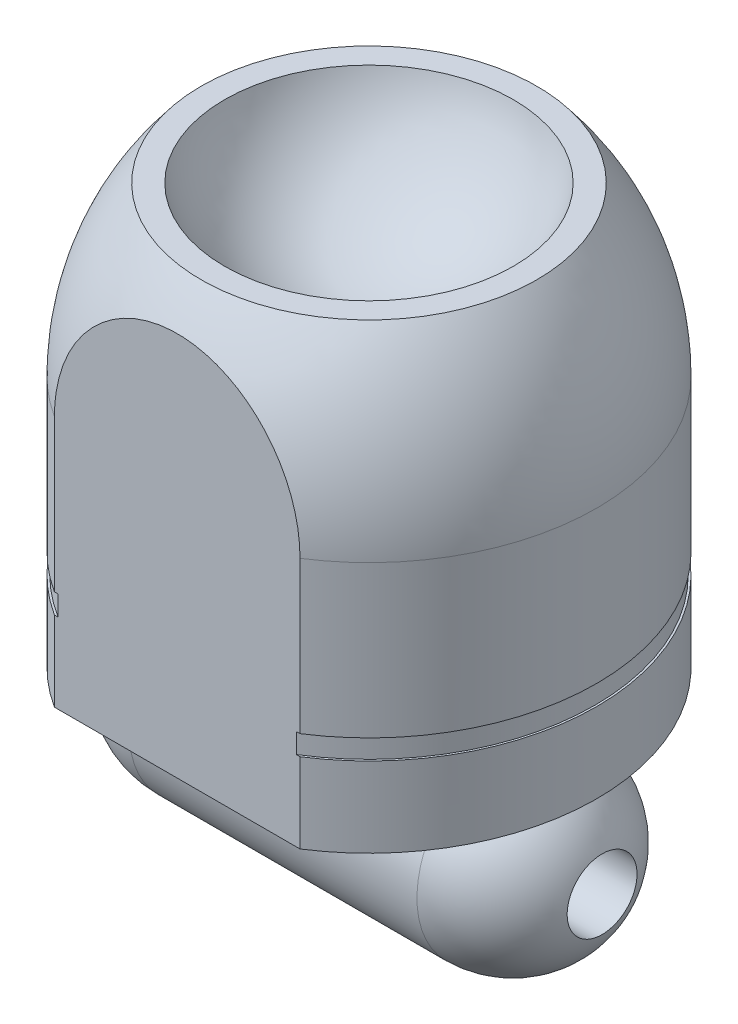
from build123d import *

# Parameters (mm, degrees)
ENL_V_MAT_EXTRU_1_DEPTH      = 265.74893784
ENL_V_MAT_EXTRU_1_DEPTH_BACK = 265.74893784
ENL_V_MAT_EXTRU_2_DEPTH      = 265.74893784
ENL_V_MAT_EXTRU_2_DEPTH_BACK = 265.74893784


with BuildPart() as part:
    # Esquisse1 → R_volution1 (revolve)
    with BuildSketch(Plane.XY):
        with BuildLine():
            Line((0, 0), (-114, 0))
            Line((-114, 0), (-114, 40))
            Line((-114, 40), (-113, 40))
            Line((-113, 40), (-113, 50))
            Line((-113, 50), (-114, 50))
            Line((-114, 50), (-114, 126))
            ThreePointArc((-114, 126), (-106.274977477, 170.598206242), (-84, 210))
            Line((-84, 210), (0, 210))
            Line((0, 210), (0, 0))
        make_face()
    revolve(axis=Axis((0, 210, 0), (0, -1, 0)))

    # Esquisse2 → Enl_v. mat.-Extru.1 (cut, two sides: drawn at the far end of the back side and taken through both)
    with BuildSketch(Plane(origin=(0, 0, 0), x_dir=(0, 0, -1), z_dir=(1, 0, 0)).offset(-ENL_V_MAT_EXTRU_1_DEPTH_BACK)):
        Polygon((-96, 872.884485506), (-96, 234.02290724), (-96, -20.030637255), (-96, -658.892215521), (-1373.723156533, -658.892215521), (-1373.723156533, 872.884485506), align=None)
    extrude(amount=ENL_V_MAT_EXTRU_1_DEPTH + ENL_V_MAT_EXTRU_1_DEPTH_BACK, mode=Mode.SUBTRACT)

    # Esquisse3 → Enl_v. mat.-Extru.2 (cut, two sides: drawn at the far end of the back side and taken through both)
    with BuildSketch(Plane(origin=(0, 0, 0), x_dir=(0, 0, -1), z_dir=(1, 0, 0)).offset(-ENL_V_MAT_EXTRU_2_DEPTH_BACK)):
        Polygon((356.669665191, 603.784274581), (114, 78), (78, 0), (-164.669665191, -525.784274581), (886.898883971, -1011.123604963), (1408.238214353, 118.444944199), align=None)
    extrude(amount=ENL_V_MAT_EXTRU_2_DEPTH + ENL_V_MAT_EXTRU_2_DEPTH_BACK, mode=Mode.SUBTRACT)

    # Esquisse4 → Enl_vement de mati_re-R_volution1 (revolve, cut)
    with BuildSketch(Plane.XY):
        with BuildLine():
            Line((0, 155), (0, 305))
            ThreePointArc((0, 305), (-75, 230), (0, 155))
        make_face()
    revolve(axis=Axis((0, 155, 0), (0, 1, 0)), mode=Mode.SUBTRACT)

    # Esquisse5 → R_volution2 (revolve)
    with BuildSketch(Plane.XY):
        with BuildLine():
            Line((72, 8), (-72, 8))
            ThreePointArc((-72, 8), (-99.055498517, -0.351544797), (-116.696196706, -22.5))
            Line((-116.696196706, -22.5), (116.696196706, -22.5))
            ThreePointArc((116.696196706, -22.5), (99.055498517, -0.351544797), (72, 8))
        make_face()
    r_volution2 = revolve(axis=Axis((132.578688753, -40, 0), (-1, 0, 0)))

    # Sym_trie1: R_volution2 across plane
    add(r_volution2.mirror(Plane(origin=(0, 0, 0), x_dir=(0, 0, 1), z_dir=(1, 0, 0))))


solid = part.part
